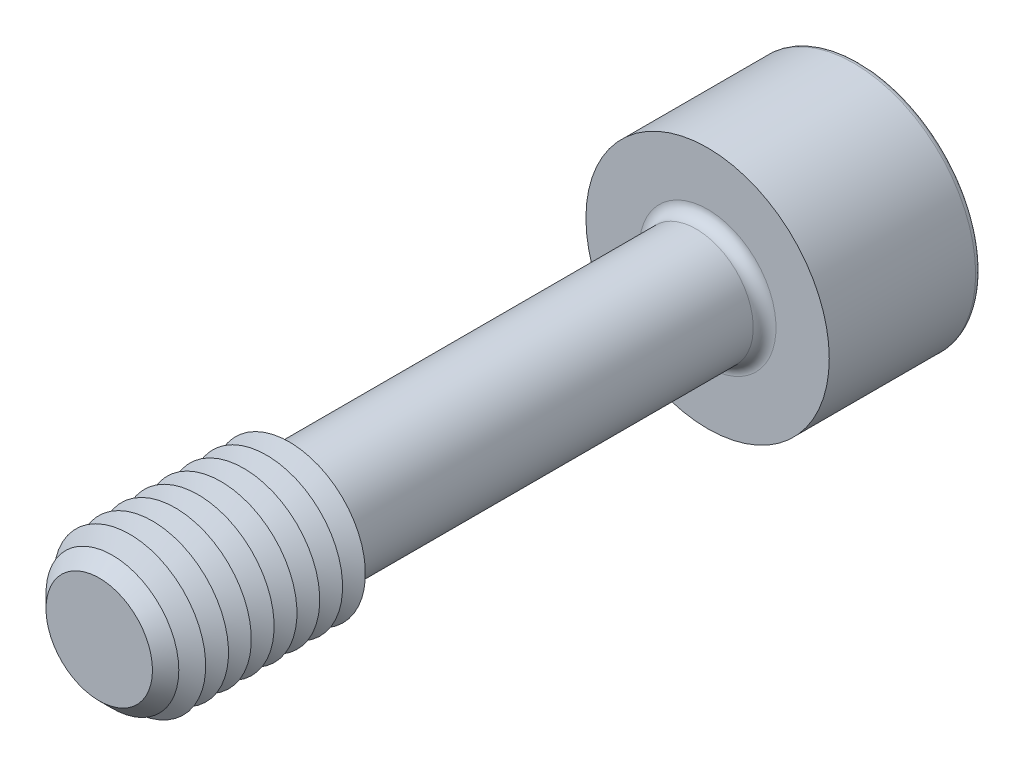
ISO-10303-21;
HEADER;
FILE_DESCRIPTION(('STEP AP214'),'2;1');
FILE_NAME('part.step','',(''),(''),'','','');
FILE_SCHEMA(('AUTOMOTIVE_DESIGN { 1 0 10303 214 1 1 1 1 }'));
ENDSEC;
DATA;
#1=APPLICATION_CONTEXT('core data for automotive mechanical design processes');
#2=APPLICATION_PROTOCOL_DEFINITION('international standard','automotive_design',2000,#1);
#3=PRODUCT_CONTEXT('',#1,'mechanical');
#4=PRODUCT('Part','Part','',(#3));
#5=PRODUCT_RELATED_PRODUCT_CATEGORY('part','',(#4));
#6=PRODUCT_DEFINITION_FORMATION('','',#4);
#7=PRODUCT_DEFINITION_CONTEXT('part definition',#1,'design');
#8=PRODUCT_DEFINITION('design','',#6,#7);
#9=PRODUCT_DEFINITION_SHAPE('','',#8);
#10=(LENGTH_UNIT() NAMED_UNIT(*) SI_UNIT(.MILLI.,.METRE.));
#11=(NAMED_UNIT(*) PLANE_ANGLE_UNIT() SI_UNIT($,.RADIAN.));
#12=(NAMED_UNIT(*) SI_UNIT($,.STERADIAN.) SOLID_ANGLE_UNIT());
#13=UNCERTAINTY_MEASURE_WITH_UNIT(LENGTH_MEASURE(1.E-05),#10,'distance_accuracy_value','');
#14=(GEOMETRIC_REPRESENTATION_CONTEXT(3) GLOBAL_UNCERTAINTY_ASSIGNED_CONTEXT((#13)) GLOBAL_UNIT_ASSIGNED_CONTEXT((#10,
#11,#12)) REPRESENTATION_CONTEXT('',''));
#15=CARTESIAN_POINT('',(0.,0.,0.));
#16=DIRECTION('',(0.,0.,1.));
#17=DIRECTION('',(1.,0.,0.));
#18=AXIS2_PLACEMENT_3D('',#15,#16,#17);
#19=CARTESIAN_POINT('',(-2.3094010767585,-4.,-22.));
#20=DIRECTION('',(0.,0.,1.));
#21=DIRECTION('',(1.,0.,0.));
#22=AXIS2_PLACEMENT_3D('',#19,#20,#21);
#23=PLANE('',#22);
#24=DIRECTION('',(1.,0.,0.));
#25=VECTOR('',#24,1.);
#26=CARTESIAN_POINT('',(-2.3094010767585,-4.,-22.));
#27=LINE('',#26,#25);
#28=CARTESIAN_POINT('',(0.,-4.,-22.));
#29=VERTEX_POINT('',#28);
#30=CARTESIAN_POINT('',(2.3094010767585,-4.,-22.));
#31=VERTEX_POINT('',#30);
#32=EDGE_CURVE('E761',#29,#31,#27,.T.);
#33=ORIENTED_EDGE('',*,*,#32,.F.);
#34=CARTESIAN_POINT('',(0.,0.,-22.));
#35=DIRECTION('',(0.,0.,1.));
#36=DIRECTION('',(0.,-1.,0.));
#37=AXIS2_PLACEMENT_3D('',#34,#35,#36);
#38=CIRCLE('',#37,4.);
#39=CARTESIAN_POINT('',(3.46410161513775,-2.,-22.));
#40=VERTEX_POINT('',#39);
#41=EDGE_CURVE('E53',#29,#40,#38,.T.);
#42=ORIENTED_EDGE('',*,*,#41,.T.);
#43=DIRECTION('',(0.5,0.866025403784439,0.));
#44=VECTOR('',#43,1.);
#45=CARTESIAN_POINT('',(2.3094010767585,-4.,-22.));
#46=LINE('',#45,#44);
#47=EDGE_CURVE('E746',#31,#40,#46,.T.);
#48=ORIENTED_EDGE('',*,*,#47,.F.);
#49=EDGE_LOOP('',(#33,#42,#48));
#50=FACE_BOUND('',#49,.T.);
#51=ADVANCED_FACE('F41',(#50),#23,.F.);
#52=CARTESIAN_POINT('',(4.618802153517,0.,-22.));
#53=VERTEX_POINT('',#52);
#54=EDGE_CURVE('E757',#40,#53,#46,.T.);
#55=ORIENTED_EDGE('',*,*,#54,.F.);
#56=CARTESIAN_POINT('',(3.46410161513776,2.,-22.));
#57=VERTEX_POINT('',#56);
#58=EDGE_CURVE('E11',#40,#57,#38,.T.);
#59=ORIENTED_EDGE('',*,*,#58,.T.);
#60=DIRECTION('',(-0.5,0.866025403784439,0.));
#61=VECTOR('',#60,1.);
#62=CARTESIAN_POINT('',(4.618802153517,0.,-22.));
#63=LINE('',#62,#61);
#64=EDGE_CURVE('E745',#53,#57,#63,.T.);
#65=ORIENTED_EDGE('',*,*,#64,.F.);
#66=EDGE_LOOP('',(#55,#59,#65));
#67=FACE_BOUND('',#66,.T.);
#68=ADVANCED_FACE('F133',(#67),#23,.F.);
#69=CARTESIAN_POINT('',(2.3094010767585,4.,-22.));
#70=VERTEX_POINT('',#69);
#71=EDGE_CURVE('E740',#57,#70,#63,.T.);
#72=ORIENTED_EDGE('',*,*,#71,.F.);
#73=CARTESIAN_POINT('',(0.,4.,-22.));
#74=VERTEX_POINT('',#73);
#75=EDGE_CURVE('E51',#57,#74,#38,.T.);
#76=ORIENTED_EDGE('',*,*,#75,.T.);
#77=DIRECTION('',(-1.,0.,0.));
#78=VECTOR('',#77,1.);
#79=CARTESIAN_POINT('',(2.3094010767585,4.,-22.));
#80=LINE('',#79,#78);
#81=EDGE_CURVE('E177',#70,#74,#80,.T.);
#82=ORIENTED_EDGE('',*,*,#81,.F.);
#83=EDGE_LOOP('',(#72,#76,#82));
#84=FACE_BOUND('',#83,.T.);
#85=ADVANCED_FACE('F139',(#84),#23,.F.);
#86=CARTESIAN_POINT('',(-2.3094010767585,4.,-22.));
#87=VERTEX_POINT('',#86);
#88=EDGE_CURVE('E751',#74,#87,#80,.T.);
#89=ORIENTED_EDGE('',*,*,#88,.F.);
#90=CARTESIAN_POINT('',(-3.46410161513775,2.,-22.));
#91=VERTEX_POINT('',#90);
#92=EDGE_CURVE('E264',#74,#91,#38,.T.);
#93=ORIENTED_EDGE('',*,*,#92,.T.);
#94=DIRECTION('',(-0.500000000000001,-0.866025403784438,0.));
#95=VECTOR('',#94,1.);
#96=CARTESIAN_POINT('',(-2.3094010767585,4.,-22.));
#97=LINE('',#96,#95);
#98=EDGE_CURVE('E176',#87,#91,#97,.T.);
#99=ORIENTED_EDGE('',*,*,#98,.F.);
#100=EDGE_LOOP('',(#89,#93,#99));
#101=FACE_BOUND('',#100,.T.);
#102=ADVANCED_FACE('F157',(#101),#23,.F.);
#103=CARTESIAN_POINT('',(-4.61880215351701,0.,-22.));
#104=VERTEX_POINT('',#103);
#105=EDGE_CURVE('E170',#91,#104,#97,.T.);
#106=ORIENTED_EDGE('',*,*,#105,.F.);
#107=CARTESIAN_POINT('',(-3.46410161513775,-2.,-22.));
#108=VERTEX_POINT('',#107);
#109=EDGE_CURVE('E172',#91,#108,#38,.T.);
#110=ORIENTED_EDGE('',*,*,#109,.T.);
#111=DIRECTION('',(0.5,-0.866025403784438,0.));
#112=VECTOR('',#111,1.);
#113=CARTESIAN_POINT('',(-4.61880215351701,0.,-22.));
#114=LINE('',#113,#112);
#115=EDGE_CURVE('E174',#104,#108,#114,.T.);
#116=ORIENTED_EDGE('',*,*,#115,.F.);
#117=EDGE_LOOP('',(#106,#110,#116));
#118=FACE_BOUND('',#117,.T.);
#119=ADVANCED_FACE('F146',(#118),#23,.F.);
#120=CARTESIAN_POINT('',(0.,0.,-30.));
#121=DIRECTION('',(0.,0.,-1.));
#122=DIRECTION('',(-1.,0.,0.));
#123=AXIS2_PLACEMENT_3D('',#120,#121,#122);
#124=PLANE('',#123);
#125=CARTESIAN_POINT('',(0.,0.,-30.));
#126=DIRECTION('',(0.,0.,-1.));
#127=DIRECTION('',(-1.,0.,0.));
#128=AXIS2_PLACEMENT_3D('',#125,#126,#127);
#129=CIRCLE('',#128,7.625);
#130=CARTESIAN_POINT('',(-7.625,0.,-30.));
#131=VERTEX_POINT('',#130);
#132=EDGE_CURVE('E250',#131,#131,#129,.T.);
#133=ORIENTED_EDGE('',*,*,#132,.T.);
#134=EDGE_LOOP('',(#133));
#135=FACE_BOUND('',#134,.T.);
#136=DIRECTION('',(-0.500000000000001,-0.866025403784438,0.));
#137=VECTOR('',#136,1.);
#138=CARTESIAN_POINT('',(-2.3094010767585,4.,-30.));
#139=LINE('',#138,#137);
#140=CARTESIAN_POINT('',(-2.3094010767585,4.,-30.));
#141=VERTEX_POINT('',#140);
#142=CARTESIAN_POINT('',(-4.61880215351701,0.,-30.));
#143=VERTEX_POINT('',#142);
#144=EDGE_CURVE('E212',#141,#143,#139,.T.);
#145=ORIENTED_EDGE('',*,*,#144,.T.);
#146=DIRECTION('',(0.5,-0.866025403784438,0.));
#147=VECTOR('',#146,1.);
#148=CARTESIAN_POINT('',(-4.61880215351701,0.,-30.));
#149=LINE('',#148,#147);
#150=CARTESIAN_POINT('',(-2.3094010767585,-4.,-30.));
#151=VERTEX_POINT('',#150);
#152=EDGE_CURVE('E67',#143,#151,#149,.T.);
#153=ORIENTED_EDGE('',*,*,#152,.T.);
#154=DIRECTION('',(1.,0.,0.));
#155=VECTOR('',#154,1.);
#156=CARTESIAN_POINT('',(-2.3094010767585,-4.,-30.));
#157=LINE('',#156,#155);
#158=CARTESIAN_POINT('',(2.3094010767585,-4.,-30.));
#159=VERTEX_POINT('',#158);
#160=EDGE_CURVE('E196',#151,#159,#157,.T.);
#161=ORIENTED_EDGE('',*,*,#160,.T.);
#162=DIRECTION('',(0.5,0.866025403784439,0.));
#163=VECTOR('',#162,1.);
#164=CARTESIAN_POINT('',(2.3094010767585,-4.,-30.));
#165=LINE('',#164,#163);
#166=CARTESIAN_POINT('',(4.618802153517,0.,-30.));
#167=VERTEX_POINT('',#166);
#168=EDGE_CURVE('E200',#159,#167,#165,.T.);
#169=ORIENTED_EDGE('',*,*,#168,.T.);
#170=DIRECTION('',(-0.5,0.866025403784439,0.));
#171=VECTOR('',#170,1.);
#172=CARTESIAN_POINT('',(4.618802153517,0.,-30.));
#173=LINE('',#172,#171);
#174=CARTESIAN_POINT('',(2.3094010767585,4.,-30.));
#175=VERTEX_POINT('',#174);
#176=EDGE_CURVE('E204',#167,#175,#173,.T.);
#177=ORIENTED_EDGE('',*,*,#176,.T.);
#178=DIRECTION('',(-1.,0.,0.));
#179=VECTOR('',#178,1.);
#180=CARTESIAN_POINT('',(2.3094010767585,4.,-30.));
#181=LINE('',#180,#179);
#182=EDGE_CURVE('E208',#175,#141,#181,.T.);
#183=ORIENTED_EDGE('',*,*,#182,.T.);
#184=EDGE_LOOP('',(#145,#153,#161,#169,#177,#183));
#185=FACE_BOUND('',#184,.T.);
#186=ADVANCED_FACE('F156',(#135,#185),#124,.T.);
#187=CARTESIAN_POINT('',(0.,0.,20.));
#188=DIRECTION('',(0.,0.,-1.));
#189=DIRECTION('',(-1.,0.,0.));
#190=AXIS2_PLACEMENT_3D('',#187,#188,#189);
#191=CYLINDRICAL_SURFACE('',#190,3.75);
#192=CARTESIAN_POINT('',(0.,0.,-19.25));
#193=DIRECTION('',(0.,0.,-1.));
#194=DIRECTION('',(-1.,0.,0.));
#195=AXIS2_PLACEMENT_3D('',#192,#193,#194);
#196=CIRCLE('',#195,3.75);
#197=CARTESIAN_POINT('',(-3.75,0.,-19.25));
#198=VERTEX_POINT('',#197);
#199=EDGE_CURVE('E247',#198,#198,#196,.F.);
#200=ORIENTED_EDGE('',*,*,#199,.T.);
#201=EDGE_LOOP('',(#200));
#202=FACE_BOUND('',#201,.T.);
#203=CARTESIAN_POINT('',(0.,0.,6.77831216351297));
#204=DIRECTION('',(0.,0.,-1.));
#205=DIRECTION('',(0.,1.,0.));
#206=AXIS2_PLACEMENT_3D('',#203,#204,#205);
#207=CIRCLE('',#206,3.75);
#208=CARTESIAN_POINT('',(0.,3.75,6.77831216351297));
#209=VERTEX_POINT('',#208);
#210=EDGE_CURVE('E235',#209,#209,#207,.T.);
#211=ORIENTED_EDGE('',*,*,#210,.T.);
#212=EDGE_LOOP('',(#211));
#213=FACE_BOUND('',#212,.T.);
#214=ADVANCED_FACE('F163',(#202,#213),#191,.T.);
#215=CARTESIAN_POINT('',(0.,0.,6.77831216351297));
#216=DIRECTION('',(0.,0.,1.));
#217=DIRECTION('',(0.,-1.,0.));
#218=AXIS2_PLACEMENT_3D('',#215,#216,#217);
#219=CONICAL_SURFACE('',#218,3.75,1.0471975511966);
#220=CARTESIAN_POINT('',(0.,0.,7.5));
#221=DIRECTION('',(0.,0.,-1.));
#222=DIRECTION('',(-1.,0.,0.));
#223=AXIS2_PLACEMENT_3D('',#220,#221,#222);
#224=CIRCLE('',#223,5.);
#225=CARTESIAN_POINT('',(-5.,0.,7.5));
#226=VERTEX_POINT('',#225);
#227=EDGE_CURVE('E268',#226,#226,#224,.T.);
#228=ORIENTED_EDGE('',*,*,#227,.T.);
#229=EDGE_LOOP('',(#228));
#230=FACE_BOUND('',#229,.T.);
#231=ORIENTED_EDGE('',*,*,#210,.F.);
#232=EDGE_LOOP('',(#231));
#233=FACE_BOUND('',#232,.T.);
#234=ADVANCED_FACE('F509',(#230,#233),#219,.T.);
#235=CARTESIAN_POINT('',(0.,0.,-20.));
#236=DIRECTION('',(0.,0.,-1.));
#237=DIRECTION('',(-1.,0.,0.));
#238=AXIS2_PLACEMENT_3D('',#235,#236,#237);
#239=PLANE('',#238);
#240=CARTESIAN_POINT('',(0.,0.,-20.));
#241=DIRECTION('',(0.,0.,-1.));
#242=DIRECTION('',(-1.,0.,0.));
#243=AXIS2_PLACEMENT_3D('',#240,#241,#242);
#244=CIRCLE('',#243,4.5);
#245=CARTESIAN_POINT('',(-4.5,0.,-20.));
#246=VERTEX_POINT('',#245);
#247=EDGE_CURVE('E243',#246,#246,#244,.T.);
#248=ORIENTED_EDGE('',*,*,#247,.T.);
#249=EDGE_LOOP('',(#248));
#250=FACE_BOUND('',#249,.T.);
#251=CARTESIAN_POINT('',(0.,0.,-20.));
#252=DIRECTION('',(0.,0.,-1.));
#253=DIRECTION('',(-1.,0.,0.));
#254=AXIS2_PLACEMENT_3D('',#251,#252,#253);
#255=CIRCLE('',#254,8.);
#256=CARTESIAN_POINT('',(-8.,0.,-20.));
#257=VERTEX_POINT('',#256);
#258=EDGE_CURVE('E231',#257,#257,#255,.T.);
#259=ORIENTED_EDGE('',*,*,#258,.F.);
#260=EDGE_LOOP('',(#259));
#261=FACE_BOUND('',#260,.T.);
#262=ADVANCED_FACE('F502',(#250,#261),#239,.F.);
#263=CARTESIAN_POINT('',(0.,0.,-30.));
#264=DIRECTION('',(0.,0.,1.));
#265=DIRECTION('',(1.,0.,0.));
#266=AXIS2_PLACEMENT_3D('',#263,#264,#265);
#267=CYLINDRICAL_SURFACE('',#266,8.);
#268=CARTESIAN_POINT('',(0.,0.,-29.625));
#269=DIRECTION('',(0.,0.,-1.));
#270=DIRECTION('',(-1.,0.,0.));
#271=AXIS2_PLACEMENT_3D('',#268,#269,#270);
#272=CIRCLE('',#271,8.);
#273=CARTESIAN_POINT('',(-8.,0.,-29.625));
#274=VERTEX_POINT('',#273);
#275=EDGE_CURVE('E253',#274,#274,#272,.F.);
#276=ORIENTED_EDGE('',*,*,#275,.T.);
#277=EDGE_LOOP('',(#276));
#278=FACE_BOUND('',#277,.T.);
#279=ORIENTED_EDGE('',*,*,#258,.T.);
#280=EDGE_LOOP('',(#279));
#281=FACE_BOUND('',#280,.T.);
#282=ADVANCED_FACE('F508',(#278,#281),#267,.T.);
#283=CARTESIAN_POINT('',(-4.61880215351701,0.,-22.));
#284=DIRECTION('',(0.866025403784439,0.5,0.));
#285=DIRECTION('',(-0.5,0.866025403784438,0.));
#286=AXIS2_PLACEMENT_3D('',#283,#284,#285);
#287=PLANE('',#286);
#288=ORIENTED_EDGE('',*,*,#152,.F.);
#289=DIRECTION('',(0.,0.,-1.));
#290=VECTOR('',#289,1.);
#291=CARTESIAN_POINT('',(-4.61880215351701,0.,-22.));
#292=LINE('',#291,#290);
#293=EDGE_CURVE('E186',#104,#143,#292,.T.);
#294=ORIENTED_EDGE('',*,*,#293,.F.);
#295=ORIENTED_EDGE('',*,*,#115,.T.);
#296=CARTESIAN_POINT('',(-2.3094010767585,-4.,-22.));
#297=VERTEX_POINT('',#296);
#298=EDGE_CURVE('E215',#108,#297,#114,.T.);
#299=ORIENTED_EDGE('',*,*,#298,.T.);
#300=DIRECTION('',(0.,0.,-1.));
#301=VECTOR('',#300,1.);
#302=CARTESIAN_POINT('',(-2.3094010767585,-4.,-22.));
#303=LINE('',#302,#301);
#304=EDGE_CURVE('E228',#297,#151,#303,.T.);
#305=ORIENTED_EDGE('',*,*,#304,.T.);
#306=EDGE_LOOP('',(#288,#294,#295,#299,#305));
#307=FACE_BOUND('',#306,.T.);
#308=ADVANCED_FACE('F520',(#307),#287,.T.);
#309=CARTESIAN_POINT('',(-2.3094010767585,-4.,-22.));
#310=DIRECTION('',(0.,1.,0.));
#311=DIRECTION('',(-1.,0.,0.));
#312=AXIS2_PLACEMENT_3D('',#309,#310,#311);
#313=PLANE('',#312);
#314=ORIENTED_EDGE('',*,*,#160,.F.);
#315=ORIENTED_EDGE('',*,*,#304,.F.);
#316=EDGE_CURVE('E758',#297,#29,#27,.T.);
#317=ORIENTED_EDGE('',*,*,#316,.T.);
#318=ORIENTED_EDGE('',*,*,#32,.T.);
#319=DIRECTION('',(0.,0.,-1.));
#320=VECTOR('',#319,1.);
#321=CARTESIAN_POINT('',(2.3094010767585,-4.,-22.));
#322=LINE('',#321,#320);
#323=EDGE_CURVE('E225',#31,#159,#322,.T.);
#324=ORIENTED_EDGE('',*,*,#323,.T.);
#325=EDGE_LOOP('',(#314,#315,#317,#318,#324));
#326=FACE_BOUND('',#325,.T.);
#327=ADVANCED_FACE('F536',(#326),#313,.T.);
#328=CARTESIAN_POINT('',(2.3094010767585,-4.,-22.));
#329=DIRECTION('',(-0.866025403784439,0.5,0.));
#330=DIRECTION('',(-0.5,-0.866025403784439,0.));
#331=AXIS2_PLACEMENT_3D('',#328,#329,#330);
#332=PLANE('',#331);
#333=ORIENTED_EDGE('',*,*,#168,.F.);
#334=ORIENTED_EDGE('',*,*,#323,.F.);
#335=ORIENTED_EDGE('',*,*,#47,.T.);
#336=ORIENTED_EDGE('',*,*,#54,.T.);
#337=DIRECTION('',(0.,0.,-1.));
#338=VECTOR('',#337,1.);
#339=CARTESIAN_POINT('',(4.618802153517,0.,-22.));
#340=LINE('',#339,#338);
#341=EDGE_CURVE('E222',#53,#167,#340,.T.);
#342=ORIENTED_EDGE('',*,*,#341,.T.);
#343=EDGE_LOOP('',(#333,#334,#335,#336,#342));
#344=FACE_BOUND('',#343,.T.);
#345=ADVANCED_FACE('F546',(#344),#332,.T.);
#346=CARTESIAN_POINT('',(4.618802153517,0.,-22.));
#347=DIRECTION('',(-0.866025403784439,-0.5,0.));
#348=DIRECTION('',(0.5,-0.866025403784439,0.));
#349=AXIS2_PLACEMENT_3D('',#346,#347,#348);
#350=PLANE('',#349);
#351=ORIENTED_EDGE('',*,*,#176,.F.);
#352=ORIENTED_EDGE('',*,*,#341,.F.);
#353=ORIENTED_EDGE('',*,*,#64,.T.);
#354=ORIENTED_EDGE('',*,*,#71,.T.);
#355=DIRECTION('',(0.,0.,-1.));
#356=VECTOR('',#355,1.);
#357=CARTESIAN_POINT('',(2.3094010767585,4.,-22.));
#358=LINE('',#357,#356);
#359=EDGE_CURVE('E219',#70,#175,#358,.T.);
#360=ORIENTED_EDGE('',*,*,#359,.T.);
#361=EDGE_LOOP('',(#351,#352,#353,#354,#360));
#362=FACE_BOUND('',#361,.T.);
#363=ADVANCED_FACE('F556',(#362),#350,.T.);
#364=CARTESIAN_POINT('',(2.3094010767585,4.,-22.));
#365=DIRECTION('',(0.,-1.,0.));
#366=DIRECTION('',(0.,0.,-1.));
#367=AXIS2_PLACEMENT_3D('',#364,#365,#366);
#368=PLANE('',#367);
#369=ORIENTED_EDGE('',*,*,#182,.F.);
#370=ORIENTED_EDGE('',*,*,#359,.F.);
#371=ORIENTED_EDGE('',*,*,#81,.T.);
#372=ORIENTED_EDGE('',*,*,#88,.T.);
#373=DIRECTION('',(0.,0.,-1.));
#374=VECTOR('',#373,1.);
#375=CARTESIAN_POINT('',(-2.3094010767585,4.,-22.));
#376=LINE('',#375,#374);
#377=EDGE_CURVE('E182',#87,#141,#376,.T.);
#378=ORIENTED_EDGE('',*,*,#377,.T.);
#379=EDGE_LOOP('',(#369,#370,#371,#372,#378));
#380=FACE_BOUND('',#379,.T.);
#381=ADVANCED_FACE('F152',(#380),#368,.T.);
#382=CARTESIAN_POINT('',(-2.3094010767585,4.,-22.));
#383=DIRECTION('',(0.866025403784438,-0.500000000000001,0.));
#384=DIRECTION('',(0.500000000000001,0.866025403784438,0.));
#385=AXIS2_PLACEMENT_3D('',#382,#383,#384);
#386=PLANE('',#385);
#387=ORIENTED_EDGE('',*,*,#144,.F.);
#388=ORIENTED_EDGE('',*,*,#377,.F.);
#389=ORIENTED_EDGE('',*,*,#98,.T.);
#390=ORIENTED_EDGE('',*,*,#105,.T.);
#391=ORIENTED_EDGE('',*,*,#293,.T.);
#392=EDGE_LOOP('',(#387,#388,#389,#390,#391));
#393=FACE_BOUND('',#392,.T.);
#394=ADVANCED_FACE('F144',(#393),#386,.T.);
#395=ORIENTED_EDGE('',*,*,#298,.F.);
#396=EDGE_CURVE('E256',#108,#29,#38,.T.);
#397=ORIENTED_EDGE('',*,*,#396,.T.);
#398=ORIENTED_EDGE('',*,*,#316,.F.);
#399=EDGE_LOOP('',(#395,#397,#398));
#400=FACE_BOUND('',#399,.T.);
#401=ADVANCED_FACE('F135',(#400),#23,.F.);
#402=CARTESIAN_POINT('',(0.,0.,-19.25));
#403=DIRECTION('',(0.,0.,-1.));
#404=DIRECTION('',(-1.,0.,0.));
#405=AXIS2_PLACEMENT_3D('',#402,#403,#404);
#406=TOROIDAL_SURFACE('',#405,4.5,0.75);
#407=ORIENTED_EDGE('',*,*,#199,.F.);
#408=EDGE_LOOP('',(#407));
#409=FACE_BOUND('',#408,.T.);
#410=ORIENTED_EDGE('',*,*,#247,.F.);
#411=EDGE_LOOP('',(#410));
#412=FACE_BOUND('',#411,.T.);
#413=ADVANCED_FACE('F129',(#409,#412),#406,.F.);
#414=CARTESIAN_POINT('',(0.,0.,-29.625));
#415=DIRECTION('',(0.,0.,-1.));
#416=DIRECTION('',(-1.,0.,0.));
#417=AXIS2_PLACEMENT_3D('',#414,#415,#416);
#418=TOROIDAL_SURFACE('',#417,7.625,0.375);
#419=ORIENTED_EDGE('',*,*,#275,.F.);
#420=EDGE_LOOP('',(#419));
#421=FACE_BOUND('',#420,.T.);
#422=ORIENTED_EDGE('',*,*,#132,.F.);
#423=EDGE_LOOP('',(#422));
#424=FACE_BOUND('',#423,.T.);
#425=ADVANCED_FACE('F43',(#421,#424),#418,.T.);
#426=CARTESIAN_POINT('',(0.,0.,-19.6905989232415));
#427=DIRECTION('',(0.,0.,-1.));
#428=DIRECTION('',(0.,1.,0.));
#429=AXIS2_PLACEMENT_3D('',#426,#427,#428);
#430=CONICAL_SURFACE('',#429,0.,1.0471975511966);
#431=ORIENTED_EDGE('',*,*,#41,.F.);
#432=ORIENTED_EDGE('',*,*,#396,.F.);
#433=ORIENTED_EDGE('',*,*,#109,.F.);
#434=ORIENTED_EDGE('',*,*,#92,.F.);
#435=ORIENTED_EDGE('',*,*,#75,.F.);
#436=ORIENTED_EDGE('',*,*,#58,.F.);
#437=EDGE_LOOP('',(#431,#432,#433,#434,#435,#436));
#438=FACE_BOUND('',#437,.T.);
#439=CARTESIAN_POINT('',(0.,0.,-19.6905989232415));
#440=VERTEX_POINT('',#439);
#441=VERTEX_LOOP('',#440);
#442=FACE_BOUND('',#441,.T.);
#443=ADVANCED_FACE('F118',(#438,#442),#430,.F.);
#444=CARTESIAN_POINT('',(0.,0.,8.25));
#445=DIRECTION('',(0.,0.,-1.));
#446=DIRECTION('',(-1.,0.,0.));
#447=AXIS2_PLACEMENT_3D('',#444,#445,#446);
#448=CONICAL_SURFACE('',#447,3.70096189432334,1.0471975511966);
#449=ORIENTED_EDGE('',*,*,#227,.F.);
#450=EDGE_LOOP('',(#449));
#451=FACE_BOUND('',#450,.T.);
#452=CARTESIAN_POINT('',(0.,0.,8.25));
#453=DIRECTION('',(0.,0.,-1.));
#454=DIRECTION('',(-1.,0.,0.));
#455=AXIS2_PLACEMENT_3D('',#452,#453,#454);
#456=CIRCLE('',#455,3.70096189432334);
#457=CARTESIAN_POINT('',(-3.70096189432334,0.,8.25));
#458=VERTEX_POINT('',#457);
#459=EDGE_CURVE('E273',#458,#458,#456,.T.);
#460=ORIENTED_EDGE('',*,*,#459,.T.);
#461=EDGE_LOOP('',(#460));
#462=FACE_BOUND('',#461,.T.);
#463=ADVANCED_FACE('F120',(#451,#462),#448,.T.);
#464=CARTESIAN_POINT('',(0.,0.,9.));
#465=DIRECTION('',(0.,0.,1.));
#466=DIRECTION('',(1.,0.,0.));
#467=AXIS2_PLACEMENT_3D('',#464,#465,#466);
#468=CONICAL_SURFACE('',#467,5.,1.0471975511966);
#469=ORIENTED_EDGE('',*,*,#459,.F.);
#470=EDGE_LOOP('',(#469));
#471=FACE_BOUND('',#470,.T.);
#472=CARTESIAN_POINT('',(0.,0.,9.));
#473=DIRECTION('',(0.,0.,-1.));
#474=DIRECTION('',(-1.,0.,0.));
#475=AXIS2_PLACEMENT_3D('',#472,#473,#474);
#476=CIRCLE('',#475,5.);
#477=CARTESIAN_POINT('',(-5.,0.,9.));
#478=VERTEX_POINT('',#477);
#479=EDGE_CURVE('E279',#478,#478,#476,.T.);
#480=ORIENTED_EDGE('',*,*,#479,.T.);
#481=EDGE_LOOP('',(#480));
#482=FACE_BOUND('',#481,.T.);
#483=ADVANCED_FACE('F126',(#471,#482),#468,.T.);
#484=CARTESIAN_POINT('',(0.,0.,9.75));
#485=DIRECTION('',(0.,0.,-1.));
#486=DIRECTION('',(-1.,0.,0.));
#487=AXIS2_PLACEMENT_3D('',#484,#485,#486);
#488=CONICAL_SURFACE('',#487,3.70096189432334,1.0471975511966);
#489=ORIENTED_EDGE('',*,*,#479,.F.);
#490=EDGE_LOOP('',(#489));
#491=FACE_BOUND('',#490,.T.);
#492=CARTESIAN_POINT('',(0.,0.,9.75));
#493=DIRECTION('',(0.,0.,-1.));
#494=DIRECTION('',(-1.,0.,0.));
#495=AXIS2_PLACEMENT_3D('',#492,#493,#494);
#496=CIRCLE('',#495,3.70096189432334);
#497=CARTESIAN_POINT('',(-3.70096189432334,0.,9.75));
#498=VERTEX_POINT('',#497);
#499=EDGE_CURVE('E285',#498,#498,#496,.T.);
#500=ORIENTED_EDGE('',*,*,#499,.T.);
#501=EDGE_LOOP('',(#500));
#502=FACE_BOUND('',#501,.T.);
#503=ADVANCED_FACE('F396',(#491,#502),#488,.T.);
#504=CARTESIAN_POINT('',(0.,0.,10.5));
#505=DIRECTION('',(0.,0.,1.));
#506=DIRECTION('',(1.,0.,0.));
#507=AXIS2_PLACEMENT_3D('',#504,#505,#506);
#508=CONICAL_SURFACE('',#507,5.,1.0471975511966);
#509=ORIENTED_EDGE('',*,*,#499,.F.);
#510=EDGE_LOOP('',(#509));
#511=FACE_BOUND('',#510,.T.);
#512=CARTESIAN_POINT('',(0.,0.,10.5));
#513=DIRECTION('',(0.,0.,-1.));
#514=DIRECTION('',(-1.,0.,0.));
#515=AXIS2_PLACEMENT_3D('',#512,#513,#514);
#516=CIRCLE('',#515,5.);
#517=CARTESIAN_POINT('',(-5.,0.,10.5));
#518=VERTEX_POINT('',#517);
#519=EDGE_CURVE('E288',#518,#518,#516,.T.);
#520=ORIENTED_EDGE('',*,*,#519,.T.);
#521=EDGE_LOOP('',(#520));
#522=FACE_BOUND('',#521,.T.);
#523=ADVANCED_FACE('F392',(#511,#522),#508,.T.);
#524=CARTESIAN_POINT('',(0.,0.,11.25));
#525=DIRECTION('',(0.,0.,-1.));
#526=DIRECTION('',(-1.,0.,0.));
#527=AXIS2_PLACEMENT_3D('',#524,#525,#526);
#528=CONICAL_SURFACE('',#527,3.70096189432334,1.0471975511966);
#529=ORIENTED_EDGE('',*,*,#519,.F.);
#530=EDGE_LOOP('',(#529));
#531=FACE_BOUND('',#530,.T.);
#532=CARTESIAN_POINT('',(0.,0.,11.25));
#533=DIRECTION('',(0.,0.,-1.));
#534=DIRECTION('',(-1.,0.,0.));
#535=AXIS2_PLACEMENT_3D('',#532,#533,#534);
#536=CIRCLE('',#535,3.70096189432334);
#537=CARTESIAN_POINT('',(-3.70096189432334,0.,11.25));
#538=VERTEX_POINT('',#537);
#539=EDGE_CURVE('E292',#538,#538,#536,.T.);
#540=ORIENTED_EDGE('',*,*,#539,.T.);
#541=EDGE_LOOP('',(#540));
#542=FACE_BOUND('',#541,.T.);
#543=ADVANCED_FACE('F388',(#531,#542),#528,.T.);
#544=CARTESIAN_POINT('',(0.,0.,12.));
#545=DIRECTION('',(0.,0.,1.));
#546=DIRECTION('',(1.,0.,0.));
#547=AXIS2_PLACEMENT_3D('',#544,#545,#546);
#548=CONICAL_SURFACE('',#547,5.,1.0471975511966);
#549=ORIENTED_EDGE('',*,*,#539,.F.);
#550=EDGE_LOOP('',(#549));
#551=FACE_BOUND('',#550,.T.);
#552=CARTESIAN_POINT('',(0.,0.,12.));
#553=DIRECTION('',(0.,0.,-1.));
#554=DIRECTION('',(-1.,0.,0.));
#555=AXIS2_PLACEMENT_3D('',#552,#553,#554);
#556=CIRCLE('',#555,5.);
#557=CARTESIAN_POINT('',(-5.,0.,12.));
#558=VERTEX_POINT('',#557);
#559=EDGE_CURVE('E296',#558,#558,#556,.T.);
#560=ORIENTED_EDGE('',*,*,#559,.T.);
#561=EDGE_LOOP('',(#560));
#562=FACE_BOUND('',#561,.T.);
#563=ADVANCED_FACE('F384',(#551,#562),#548,.T.);
#564=CARTESIAN_POINT('',(0.,0.,12.75));
#565=DIRECTION('',(0.,0.,-1.));
#566=DIRECTION('',(-1.,0.,0.));
#567=AXIS2_PLACEMENT_3D('',#564,#565,#566);
#568=CONICAL_SURFACE('',#567,3.70096189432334,1.0471975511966);
#569=ORIENTED_EDGE('',*,*,#559,.F.);
#570=EDGE_LOOP('',(#569));
#571=FACE_BOUND('',#570,.T.);
#572=CARTESIAN_POINT('',(0.,0.,12.75));
#573=DIRECTION('',(0.,0.,-1.));
#574=DIRECTION('',(-1.,0.,0.));
#575=AXIS2_PLACEMENT_3D('',#572,#573,#574);
#576=CIRCLE('',#575,3.70096189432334);
#577=CARTESIAN_POINT('',(-3.70096189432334,0.,12.75));
#578=VERTEX_POINT('',#577);
#579=EDGE_CURVE('E300',#578,#578,#576,.T.);
#580=ORIENTED_EDGE('',*,*,#579,.T.);
#581=EDGE_LOOP('',(#580));
#582=FACE_BOUND('',#581,.T.);
#583=ADVANCED_FACE('F380',(#571,#582),#568,.T.);
#584=CARTESIAN_POINT('',(0.,0.,13.5));
#585=DIRECTION('',(0.,0.,1.));
#586=DIRECTION('',(1.,0.,0.));
#587=AXIS2_PLACEMENT_3D('',#584,#585,#586);
#588=CONICAL_SURFACE('',#587,5.,1.0471975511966);
#589=ORIENTED_EDGE('',*,*,#579,.F.);
#590=EDGE_LOOP('',(#589));
#591=FACE_BOUND('',#590,.T.);
#592=CARTESIAN_POINT('',(0.,0.,13.5));
#593=DIRECTION('',(0.,0.,-1.));
#594=DIRECTION('',(-1.,0.,0.));
#595=AXIS2_PLACEMENT_3D('',#592,#593,#594);
#596=CIRCLE('',#595,5.);
#597=CARTESIAN_POINT('',(-5.,0.,13.5));
#598=VERTEX_POINT('',#597);
#599=EDGE_CURVE('E304',#598,#598,#596,.T.);
#600=ORIENTED_EDGE('',*,*,#599,.T.);
#601=EDGE_LOOP('',(#600));
#602=FACE_BOUND('',#601,.T.);
#603=ADVANCED_FACE('F376',(#591,#602),#588,.T.);
#604=CARTESIAN_POINT('',(0.,0.,14.25));
#605=DIRECTION('',(0.,0.,-1.));
#606=DIRECTION('',(-1.,0.,0.));
#607=AXIS2_PLACEMENT_3D('',#604,#605,#606);
#608=CONICAL_SURFACE('',#607,3.70096189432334,1.0471975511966);
#609=ORIENTED_EDGE('',*,*,#599,.F.);
#610=EDGE_LOOP('',(#609));
#611=FACE_BOUND('',#610,.T.);
#612=CARTESIAN_POINT('',(0.,0.,14.25));
#613=DIRECTION('',(0.,0.,-1.));
#614=DIRECTION('',(-1.,0.,0.));
#615=AXIS2_PLACEMENT_3D('',#612,#613,#614);
#616=CIRCLE('',#615,3.70096189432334);
#617=CARTESIAN_POINT('',(-3.70096189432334,0.,14.25));
#618=VERTEX_POINT('',#617);
#619=EDGE_CURVE('E308',#618,#618,#616,.T.);
#620=ORIENTED_EDGE('',*,*,#619,.T.);
#621=EDGE_LOOP('',(#620));
#622=FACE_BOUND('',#621,.T.);
#623=ADVANCED_FACE('F372',(#611,#622),#608,.T.);
#624=CARTESIAN_POINT('',(0.,0.,15.));
#625=DIRECTION('',(0.,0.,1.));
#626=DIRECTION('',(1.,0.,0.));
#627=AXIS2_PLACEMENT_3D('',#624,#625,#626);
#628=CONICAL_SURFACE('',#627,5.,1.0471975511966);
#629=ORIENTED_EDGE('',*,*,#619,.F.);
#630=EDGE_LOOP('',(#629));
#631=FACE_BOUND('',#630,.T.);
#632=CARTESIAN_POINT('',(0.,0.,15.));
#633=DIRECTION('',(0.,0.,-1.));
#634=DIRECTION('',(-1.,0.,0.));
#635=AXIS2_PLACEMENT_3D('',#632,#633,#634);
#636=CIRCLE('',#635,5.);
#637=CARTESIAN_POINT('',(-5.,0.,15.));
#638=VERTEX_POINT('',#637);
#639=EDGE_CURVE('E312',#638,#638,#636,.T.);
#640=ORIENTED_EDGE('',*,*,#639,.T.);
#641=EDGE_LOOP('',(#640));
#642=FACE_BOUND('',#641,.T.);
#643=ADVANCED_FACE('F368',(#631,#642),#628,.T.);
#644=CARTESIAN_POINT('',(0.,0.,15.75));
#645=DIRECTION('',(0.,0.,-1.));
#646=DIRECTION('',(-1.,0.,0.));
#647=AXIS2_PLACEMENT_3D('',#644,#645,#646);
#648=CONICAL_SURFACE('',#647,3.70096189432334,1.0471975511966);
#649=ORIENTED_EDGE('',*,*,#639,.F.);
#650=EDGE_LOOP('',(#649));
#651=FACE_BOUND('',#650,.T.);
#652=CARTESIAN_POINT('',(0.,0.,15.75));
#653=DIRECTION('',(0.,0.,-1.));
#654=DIRECTION('',(-1.,0.,0.));
#655=AXIS2_PLACEMENT_3D('',#652,#653,#654);
#656=CIRCLE('',#655,3.70096189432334);
#657=CARTESIAN_POINT('',(-3.70096189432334,0.,15.75));
#658=VERTEX_POINT('',#657);
#659=EDGE_CURVE('E316',#658,#658,#656,.T.);
#660=ORIENTED_EDGE('',*,*,#659,.T.);
#661=EDGE_LOOP('',(#660));
#662=FACE_BOUND('',#661,.T.);
#663=ADVANCED_FACE('F364',(#651,#662),#648,.T.);
#664=CARTESIAN_POINT('',(0.,0.,16.5));
#665=DIRECTION('',(0.,0.,1.));
#666=DIRECTION('',(1.,0.,0.));
#667=AXIS2_PLACEMENT_3D('',#664,#665,#666);
#668=CONICAL_SURFACE('',#667,5.,1.0471975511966);
#669=ORIENTED_EDGE('',*,*,#659,.F.);
#670=EDGE_LOOP('',(#669));
#671=FACE_BOUND('',#670,.T.);
#672=CARTESIAN_POINT('',(0.,0.,16.5));
#673=DIRECTION('',(0.,0.,-1.));
#674=DIRECTION('',(-1.,0.,0.));
#675=AXIS2_PLACEMENT_3D('',#672,#673,#674);
#676=CIRCLE('',#675,5.);
#677=CARTESIAN_POINT('',(-5.,0.,16.5));
#678=VERTEX_POINT('',#677);
#679=EDGE_CURVE('E319',#678,#678,#676,.T.);
#680=ORIENTED_EDGE('',*,*,#679,.T.);
#681=EDGE_LOOP('',(#680));
#682=FACE_BOUND('',#681,.T.);
#683=ADVANCED_FACE('F360',(#671,#682),#668,.T.);
#684=CARTESIAN_POINT('',(0.,0.,17.25));
#685=DIRECTION('',(0.,0.,-1.));
#686=DIRECTION('',(-1.,0.,0.));
#687=AXIS2_PLACEMENT_3D('',#684,#685,#686);
#688=CONICAL_SURFACE('',#687,3.70096189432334,1.0471975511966);
#689=ORIENTED_EDGE('',*,*,#679,.F.);
#690=EDGE_LOOP('',(#689));
#691=FACE_BOUND('',#690,.T.);
#692=CARTESIAN_POINT('',(0.,0.,17.25));
#693=DIRECTION('',(0.,0.,-1.));
#694=DIRECTION('',(-1.,0.,0.));
#695=AXIS2_PLACEMENT_3D('',#692,#693,#694);
#696=CIRCLE('',#695,3.70096189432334);
#697=CARTESIAN_POINT('',(-3.70096189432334,0.,17.25));
#698=VERTEX_POINT('',#697);
#699=EDGE_CURVE('E322',#698,#698,#696,.T.);
#700=ORIENTED_EDGE('',*,*,#699,.T.);
#701=EDGE_LOOP('',(#700));
#702=FACE_BOUND('',#701,.T.);
#703=ADVANCED_FACE('F356',(#691,#702),#688,.T.);
#704=CARTESIAN_POINT('',(0.,0.,18.));
#705=DIRECTION('',(0.,0.,1.));
#706=DIRECTION('',(1.,0.,0.));
#707=AXIS2_PLACEMENT_3D('',#704,#705,#706);
#708=CONICAL_SURFACE('',#707,5.,1.0471975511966);
#709=ORIENTED_EDGE('',*,*,#699,.F.);
#710=EDGE_LOOP('',(#709));
#711=FACE_BOUND('',#710,.T.);
#712=CARTESIAN_POINT('',(0.,0.,18.));
#713=DIRECTION('',(0.,0.,-1.));
#714=DIRECTION('',(-1.,0.,0.));
#715=AXIS2_PLACEMENT_3D('',#712,#713,#714);
#716=CIRCLE('',#715,5.);
#717=CARTESIAN_POINT('',(-5.,0.,18.));
#718=VERTEX_POINT('',#717);
#719=EDGE_CURVE('E326',#718,#718,#716,.T.);
#720=ORIENTED_EDGE('',*,*,#719,.T.);
#721=EDGE_LOOP('',(#720));
#722=FACE_BOUND('',#721,.T.);
#723=ADVANCED_FACE('F349',(#711,#722),#708,.T.);
#724=CARTESIAN_POINT('',(0.,0.,18.75));
#725=DIRECTION('',(0.,0.,-1.));
#726=DIRECTION('',(-1.,0.,0.));
#727=AXIS2_PLACEMENT_3D('',#724,#725,#726);
#728=CONICAL_SURFACE('',#727,3.70096189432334,1.0471975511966);
#729=ORIENTED_EDGE('',*,*,#719,.F.);
#730=EDGE_LOOP('',(#729));
#731=FACE_BOUND('',#730,.T.);
#732=CARTESIAN_POINT('',(0.,0.,18.75));
#733=DIRECTION('',(0.,0.,-1.));
#734=DIRECTION('',(-1.,0.,0.));
#735=AXIS2_PLACEMENT_3D('',#732,#733,#734);
#736=CIRCLE('',#735,3.70096189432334);
#737=CARTESIAN_POINT('',(-3.70096189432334,0.,18.75));
#738=VERTEX_POINT('',#737);
#739=EDGE_CURVE('E330',#738,#738,#736,.T.);
#740=ORIENTED_EDGE('',*,*,#739,.T.);
#741=EDGE_LOOP('',(#740));
#742=FACE_BOUND('',#741,.T.);
#743=ADVANCED_FACE('F335',(#731,#742),#728,.T.);
#744=CARTESIAN_POINT('',(0.,0.,19.5));
#745=DIRECTION('',(0.,0.,1.));
#746=DIRECTION('',(1.,0.,0.));
#747=AXIS2_PLACEMENT_3D('',#744,#745,#746);
#748=CONICAL_SURFACE('',#747,5.,1.0471975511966);
#749=CARTESIAN_POINT('',(0.,0.,19.1339745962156));
#750=DIRECTION('',(0.,0.,1.));
#751=DIRECTION('',(1.,0.,0.));
#752=AXIS2_PLACEMENT_3D('',#749,#750,#751);
#753=CIRCLE('',#752,4.36602540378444);
#754=CARTESIAN_POINT('',(4.36602540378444,0.,19.1339745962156));
#755=VERTEX_POINT('',#754);
#756=EDGE_CURVE('E45',#755,#755,#753,.F.);
#757=ORIENTED_EDGE('',*,*,#756,.T.);
#758=EDGE_LOOP('',(#757));
#759=FACE_BOUND('',#758,.T.);
#760=ORIENTED_EDGE('',*,*,#739,.F.);
#761=EDGE_LOOP('',(#760));
#762=FACE_BOUND('',#761,.T.);
#763=ADVANCED_FACE('F337',(#759,#762),#748,.T.);
#764=CARTESIAN_POINT('',(0.,0.,20.));
#765=DIRECTION('',(0.,0.,1.));
#766=DIRECTION('',(1.,0.,0.));
#767=AXIS2_PLACEMENT_3D('',#764,#765,#766);
#768=PLANE('',#767);
#769=CARTESIAN_POINT('',(0.,0.,20.));
#770=DIRECTION('',(0.,0.,1.));
#771=DIRECTION('',(1.,0.,0.));
#772=AXIS2_PLACEMENT_3D('',#769,#770,#771);
#773=CIRCLE('',#772,3.5);
#774=CARTESIAN_POINT('',(3.5,0.,20.));
#775=VERTEX_POINT('',#774);
#776=EDGE_CURVE('E239',#775,#775,#773,.T.);
#777=ORIENTED_EDGE('',*,*,#776,.T.);
#778=EDGE_LOOP('',(#777));
#779=FACE_BOUND('',#778,.T.);
#780=ADVANCED_FACE('F339',(#779),#768,.T.);
#781=CARTESIAN_POINT('',(0.,0.,18.5));
#782=DIRECTION('',(0.,0.,-1.));
#783=DIRECTION('',(0.,1.,0.));
#784=AXIS2_PLACEMENT_3D('',#781,#782,#783);
#785=CONICAL_SURFACE('',#784,5.,0.785398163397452);
#786=ORIENTED_EDGE('',*,*,#756,.F.);
#787=EDGE_LOOP('',(#786));
#788=FACE_BOUND('',#787,.T.);
#789=ORIENTED_EDGE('',*,*,#776,.F.);
#790=EDGE_LOOP('',(#789));
#791=FACE_BOUND('',#790,.T.);
#792=ADVANCED_FACE('F346',(#788,#791),#785,.T.);
#793=CLOSED_SHELL('',(#51,#68,#85,#102,#119,#186,#214,#234,#262,#282,#308,#327,#345,#363,#381,
#394,#401,#413,#425,#443,#463,#483,#503,#523,#543,#563,#583,#603,#623,#643,#663,#683,#703,#723,
#743,#763,#780,#792));
#794=MANIFOLD_SOLID_BREP('B2',#793);
#795=ADVANCED_BREP_SHAPE_REPRESENTATION('',(#18,#794),#14);
#796=SHAPE_DEFINITION_REPRESENTATION(#9,#795);
ENDSEC;
END-ISO-10303-21;
